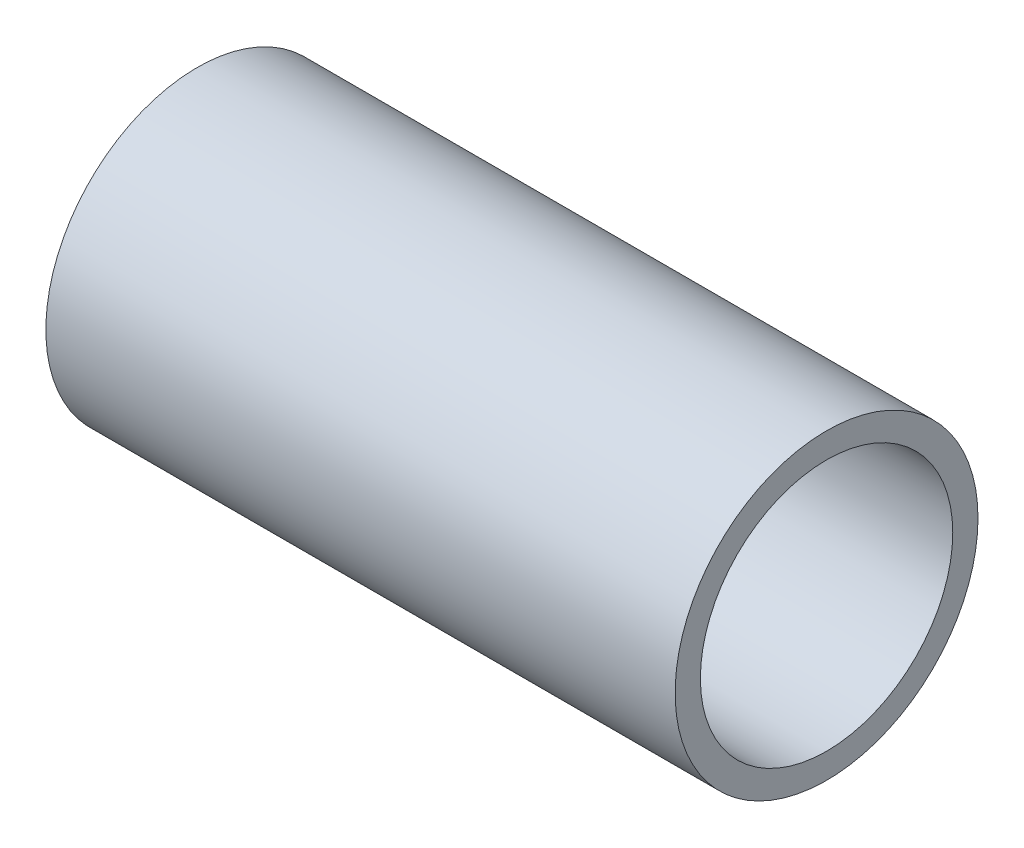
ISO-10303-21;
HEADER;
FILE_DESCRIPTION(('STEP AP214'),'2;1');
FILE_NAME('part.step','',(''),(''),'','','');
FILE_SCHEMA(('AUTOMOTIVE_DESIGN { 1 0 10303 214 1 1 1 1 }'));
ENDSEC;
DATA;
#1=APPLICATION_CONTEXT('core data for automotive mechanical design processes');
#2=APPLICATION_PROTOCOL_DEFINITION('international standard','automotive_design',2000,#1);
#3=PRODUCT_CONTEXT('',#1,'mechanical');
#4=PRODUCT('Part','Part','',(#3));
#5=PRODUCT_RELATED_PRODUCT_CATEGORY('part','',(#4));
#6=PRODUCT_DEFINITION_FORMATION('','',#4);
#7=PRODUCT_DEFINITION_CONTEXT('part definition',#1,'design');
#8=PRODUCT_DEFINITION('design','',#6,#7);
#9=PRODUCT_DEFINITION_SHAPE('','',#8);
#10=(LENGTH_UNIT() NAMED_UNIT(*) SI_UNIT(.MILLI.,.METRE.));
#11=(NAMED_UNIT(*) PLANE_ANGLE_UNIT() SI_UNIT($,.RADIAN.));
#12=(NAMED_UNIT(*) SI_UNIT($,.STERADIAN.) SOLID_ANGLE_UNIT());
#13=UNCERTAINTY_MEASURE_WITH_UNIT(LENGTH_MEASURE(1.E-05),#10,'distance_accuracy_value','');
#14=(GEOMETRIC_REPRESENTATION_CONTEXT(3) GLOBAL_UNCERTAINTY_ASSIGNED_CONTEXT((#13)) GLOBAL_UNIT_ASSIGNED_CONTEXT((#10,
#11,#12)) REPRESENTATION_CONTEXT('',''));
#15=CARTESIAN_POINT('',(0.,0.,0.));
#16=DIRECTION('',(0.,0.,1.));
#17=DIRECTION('',(1.,0.,0.));
#18=AXIS2_PLACEMENT_3D('',#15,#16,#17);
#19=CARTESIAN_POINT('',(62.334813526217,25.0000000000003,0.));
#20=DIRECTION('',(1.,0.,0.));
#21=DIRECTION('',(0.,0.,-1.));
#22=AXIS2_PLACEMENT_3D('',#19,#20,#21);
#23=PLANE('',#22);
#24=CARTESIAN_POINT('',(62.334813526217,0.,0.));
#25=DIRECTION('',(1.,0.,0.));
#26=DIRECTION('',(0.,0.,-1.));
#27=AXIS2_PLACEMENT_3D('',#24,#25,#26);
#28=CIRCLE('',#27,30.0000000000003);
#29=CARTESIAN_POINT('',(62.334813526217,0.,-30.0000000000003));
#30=VERTEX_POINT('',#29);
#31=EDGE_CURVE('E42',#30,#30,#28,.T.);
#32=ORIENTED_EDGE('',*,*,#31,.T.);
#33=EDGE_LOOP('',(#32));
#34=FACE_BOUND('',#33,.T.);
#35=CARTESIAN_POINT('',(62.334813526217,0.,0.));
#36=DIRECTION('',(1.,0.,0.));
#37=DIRECTION('',(0.,0.,-1.));
#38=AXIS2_PLACEMENT_3D('',#35,#36,#37);
#39=CIRCLE('',#38,25.0000000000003);
#40=CARTESIAN_POINT('',(62.334813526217,0.,-25.0000000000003));
#41=VERTEX_POINT('',#40);
#42=EDGE_CURVE('E10',#41,#41,#39,.T.);
#43=ORIENTED_EDGE('',*,*,#42,.F.);
#44=EDGE_LOOP('',(#43));
#45=FACE_BOUND('',#44,.T.);
#46=ADVANCED_FACE('F28',(#34,#45),#23,.T.);
#47=CARTESIAN_POINT('',(0.,0.,0.));
#48=DIRECTION('',(1.,0.,0.));
#49=DIRECTION('',(0.,0.,-1.));
#50=AXIS2_PLACEMENT_3D('',#47,#48,#49);
#51=CYLINDRICAL_SURFACE('',#50,25.0000000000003);
#52=ORIENTED_EDGE('',*,*,#42,.T.);
#53=EDGE_LOOP('',(#52));
#54=FACE_BOUND('',#53,.T.);
#55=CARTESIAN_POINT('',(-62.334813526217,0.,0.));
#56=DIRECTION('',(1.,0.,0.));
#57=DIRECTION('',(0.,0.,-1.));
#58=AXIS2_PLACEMENT_3D('',#55,#56,#57);
#59=CIRCLE('',#58,25.0000000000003);
#60=CARTESIAN_POINT('',(-62.334813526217,0.,-25.0000000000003));
#61=VERTEX_POINT('',#60);
#62=EDGE_CURVE('E34',#61,#61,#59,.T.);
#63=ORIENTED_EDGE('',*,*,#62,.F.);
#64=EDGE_LOOP('',(#63));
#65=FACE_BOUND('',#64,.T.);
#66=ADVANCED_FACE('F58',(#54,#65),#51,.F.);
#67=CARTESIAN_POINT('',(-62.334813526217,25.0000000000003,0.));
#68=DIRECTION('',(-1.,0.,0.));
#69=DIRECTION('',(0.,0.,1.));
#70=AXIS2_PLACEMENT_3D('',#67,#68,#69);
#71=PLANE('',#70);
#72=ORIENTED_EDGE('',*,*,#62,.T.);
#73=EDGE_LOOP('',(#72));
#74=FACE_BOUND('',#73,.T.);
#75=CARTESIAN_POINT('',(-62.334813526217,0.,0.));
#76=DIRECTION('',(1.,0.,0.));
#77=DIRECTION('',(0.,0.,-1.));
#78=AXIS2_PLACEMENT_3D('',#75,#76,#77);
#79=CIRCLE('',#78,30.0000000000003);
#80=CARTESIAN_POINT('',(-62.334813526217,0.,-30.0000000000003));
#81=VERTEX_POINT('',#80);
#82=EDGE_CURVE('E38',#81,#81,#79,.T.);
#83=ORIENTED_EDGE('',*,*,#82,.F.);
#84=EDGE_LOOP('',(#83));
#85=FACE_BOUND('',#84,.T.);
#86=ADVANCED_FACE('F52',(#74,#85),#71,.T.);
#87=CARTESIAN_POINT('',(0.,0.,0.));
#88=DIRECTION('',(1.,0.,0.));
#89=DIRECTION('',(0.,0.,-1.));
#90=AXIS2_PLACEMENT_3D('',#87,#88,#89);
#91=CYLINDRICAL_SURFACE('',#90,30.0000000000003);
#92=ORIENTED_EDGE('',*,*,#82,.T.);
#93=EDGE_LOOP('',(#92));
#94=FACE_BOUND('',#93,.T.);
#95=ORIENTED_EDGE('',*,*,#31,.F.);
#96=EDGE_LOOP('',(#95));
#97=FACE_BOUND('',#96,.T.);
#98=ADVANCED_FACE('F50',(#94,#97),#91,.T.);
#99=CLOSED_SHELL('',(#46,#66,#86,#98));
#100=MANIFOLD_SOLID_BREP('B2',#99);
#101=ADVANCED_BREP_SHAPE_REPRESENTATION('',(#18,#100),#14);
#102=SHAPE_DEFINITION_REPRESENTATION(#9,#101);
ENDSEC;
END-ISO-10303-21;
